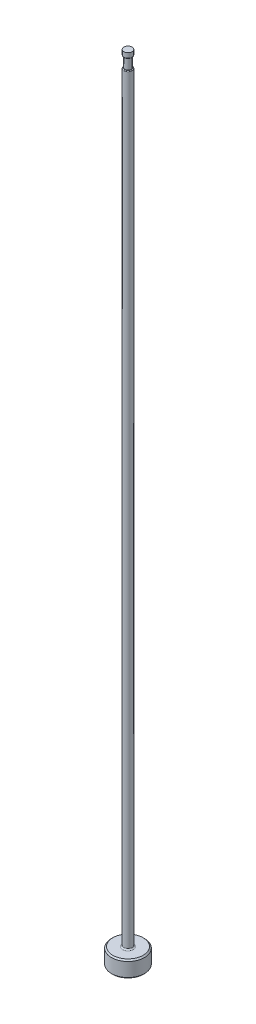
ISO-10303-21;
HEADER;
FILE_DESCRIPTION(('STEP AP214'),'2;1');
FILE_NAME('part.step','',(''),(''),'','','');
FILE_SCHEMA(('AUTOMOTIVE_DESIGN { 1 0 10303 214 1 1 1 1 }'));
ENDSEC;
DATA;
#1=APPLICATION_CONTEXT('core data for automotive mechanical design processes');
#2=APPLICATION_PROTOCOL_DEFINITION('international standard','automotive_design',2000,#1);
#3=PRODUCT_CONTEXT('',#1,'mechanical');
#4=PRODUCT('Part','Part','',(#3));
#5=PRODUCT_RELATED_PRODUCT_CATEGORY('part','',(#4));
#6=PRODUCT_DEFINITION_FORMATION('','',#4);
#7=PRODUCT_DEFINITION_CONTEXT('part definition',#1,'design');
#8=PRODUCT_DEFINITION('design','',#6,#7);
#9=PRODUCT_DEFINITION_SHAPE('','',#8);
#10=(LENGTH_UNIT() NAMED_UNIT(*) SI_UNIT(.MILLI.,.METRE.));
#11=(NAMED_UNIT(*) PLANE_ANGLE_UNIT() SI_UNIT($,.RADIAN.));
#12=(NAMED_UNIT(*) SI_UNIT($,.STERADIAN.) SOLID_ANGLE_UNIT());
#13=UNCERTAINTY_MEASURE_WITH_UNIT(LENGTH_MEASURE(1.E-05),#10,'distance_accuracy_value','');
#14=(GEOMETRIC_REPRESENTATION_CONTEXT(3) GLOBAL_UNCERTAINTY_ASSIGNED_CONTEXT((#13)) GLOBAL_UNIT_ASSIGNED_CONTEXT((#10,
#11,#12)) REPRESENTATION_CONTEXT('',''));
#15=CARTESIAN_POINT('',(0.,0.,0.));
#16=DIRECTION('',(0.,0.,1.));
#17=DIRECTION('',(1.,0.,0.));
#18=AXIS2_PLACEMENT_3D('',#15,#16,#17);
#19=CARTESIAN_POINT('',(-0.793749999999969,151.384,0.));
#20=DIRECTION('',(0.,1.,0.));
#21=DIRECTION('',(0.,0.,1.));
#22=AXIS2_PLACEMENT_3D('',#19,#20,#21);
#23=PLANE('',#22);
#24=CARTESIAN_POINT('',(0.,151.384,0.));
#25=DIRECTION('',(0.,1.,0.));
#26=DIRECTION('',(0.,0.,1.));
#27=AXIS2_PLACEMENT_3D('',#24,#25,#26);
#28=CIRCLE('',#27,0.661669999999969);
#29=CARTESIAN_POINT('',(0.,151.384,0.661669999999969));
#30=VERTEX_POINT('',#29);
#31=EDGE_CURVE('E11',#30,#30,#28,.F.);
#32=ORIENTED_EDGE('',*,*,#31,.T.);
#33=EDGE_LOOP('',(#32));
#34=FACE_BOUND('',#33,.T.);
#35=CARTESIAN_POINT('',(0.,151.384,0.));
#36=DIRECTION('',(0.,1.,0.));
#37=DIRECTION('',(0.,0.,1.));
#38=AXIS2_PLACEMENT_3D('',#35,#36,#37);
#39=CIRCLE('',#38,0.590549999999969);
#40=CARTESIAN_POINT('',(0.,151.384,0.590549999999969));
#41=VERTEX_POINT('',#40);
#42=EDGE_CURVE('E80',#41,#41,#39,.T.);
#43=ORIENTED_EDGE('',*,*,#42,.T.);
#44=EDGE_LOOP('',(#43));
#45=FACE_BOUND('',#44,.T.);
#46=ADVANCED_FACE('F38',(#34,#45),#23,.F.);
#47=CARTESIAN_POINT('',(0.,259.958771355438,0.));
#48=DIRECTION('',(0.,1.,0.));
#49=DIRECTION('',(0.,0.,1.));
#50=AXIS2_PLACEMENT_3D('',#47,#48,#49);
#51=CYLINDRICAL_SURFACE('',#50,0.793749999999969);
#52=DIRECTION('',(0.,1.,0.));
#53=VECTOR('',#52,1.);
#54=CARTESIAN_POINT('',(-0.590549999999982,259.958771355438,-0.530367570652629));
#55=LINE('',#54,#53);
#56=CARTESIAN_POINT('',(-0.590549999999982,149.225,-0.530367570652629));
#57=VERTEX_POINT('',#56);
#58=CARTESIAN_POINT('',(-0.590549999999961,86.868,-0.530367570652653));
#59=VERTEX_POINT('',#58);
#60=EDGE_CURVE('E75',#57,#59,#55,.F.);
#61=ORIENTED_EDGE('',*,*,#60,.F.);
#62=CARTESIAN_POINT('',(0.,149.225,0.));
#63=DIRECTION('',(0.,-1.,0.));
#64=DIRECTION('',(0.,0.,-1.));
#65=AXIS2_PLACEMENT_3D('',#62,#63,#64);
#66=CIRCLE('',#65,0.793749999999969);
#67=CARTESIAN_POINT('',(-0.590549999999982,149.225,0.530367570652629));
#68=VERTEX_POINT('',#67);
#69=EDGE_CURVE('E53',#57,#68,#66,.T.);
#70=ORIENTED_EDGE('',*,*,#69,.T.);
#71=DIRECTION('',(0.,1.,0.));
#72=VECTOR('',#71,1.);
#73=CARTESIAN_POINT('',(-0.590549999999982,259.958771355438,0.530367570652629));
#74=LINE('',#73,#72);
#75=CARTESIAN_POINT('',(-0.590549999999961,86.868,0.530367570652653));
#76=VERTEX_POINT('',#75);
#77=EDGE_CURVE('E86',#76,#68,#74,.T.);
#78=ORIENTED_EDGE('',*,*,#77,.F.);
#79=CARTESIAN_POINT('',(-0.590549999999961,86.868,-0.530367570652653));
#80=CARTESIAN_POINT('',(-0.59053917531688,86.8121966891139,-0.530314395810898));
#81=CARTESIAN_POINT('',(-0.592020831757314,86.7563728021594,-0.528725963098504));
#82=CARTESIAN_POINT('',(-0.597911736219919,86.6448205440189,-0.522091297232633));
#83=CARTESIAN_POINT('',(-0.60233497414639,86.5890939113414,-0.517028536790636));
#84=CARTESIAN_POINT('',(-0.614284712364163,86.4762022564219,-0.502771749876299));
#85=CARTESIAN_POINT('',(-0.62192823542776,86.4190688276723,-0.493420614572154));
#86=CARTESIAN_POINT('',(-0.640090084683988,86.3064288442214,-0.469629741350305));
#87=CARTESIAN_POINT('',(-0.650601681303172,86.2509188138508,-0.455201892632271));
#88=CARTESIAN_POINT('',(-0.672694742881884,86.1487751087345,-0.421752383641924));
#89=CARTESIAN_POINT('',(-0.684015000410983,86.1018538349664,-0.403447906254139));
#90=CARTESIAN_POINT('',(-0.70779345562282,86.0119254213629,-0.360113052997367));
#91=CARTESIAN_POINT('',(-0.720238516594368,85.9688824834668,-0.335155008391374));
#92=CARTESIAN_POINT('',(-0.738199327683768,85.9108429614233,-0.292081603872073));
#93=CARTESIAN_POINT('',(-0.74383162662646,85.8932421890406,-0.277537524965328));
#94=CARTESIAN_POINT('',(-0.754779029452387,85.8599385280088,-0.246220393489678));
#95=CARTESIAN_POINT('',(-0.760093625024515,85.8442386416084,-0.229443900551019));
#96=CARTESIAN_POINT('',(-0.770096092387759,85.8153279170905,-0.193256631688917));
#97=CARTESIAN_POINT('',(-0.774774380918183,85.8021541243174,-0.173812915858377));
#98=CARTESIAN_POINT('',(-0.782879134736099,85.779678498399,-0.132572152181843));
#99=CARTESIAN_POINT('',(-0.786309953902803,85.7703631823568,-0.110783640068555));
#100=CARTESIAN_POINT('',(-0.790553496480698,85.7589260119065,-0.0728220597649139));
#101=CARTESIAN_POINT('',(-0.79185392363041,85.7554525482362,-0.0571082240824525));
#102=CARTESIAN_POINT('',(-0.793506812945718,85.7510442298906,-0.0252785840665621));
#103=CARTESIAN_POINT('',(-0.79385989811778,85.7501077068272,-0.00916305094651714));
#104=CARTESIAN_POINT('',(-0.793579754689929,85.7508527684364,0.0230049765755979));
#105=CARTESIAN_POINT('',(-0.792946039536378,85.7525356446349,0.0390574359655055));
#106=CARTESIAN_POINT('',(-0.790759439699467,85.7583804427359,0.0706385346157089));
#107=CARTESIAN_POINT('',(-0.789205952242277,85.7625439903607,0.0861668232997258));
#108=CARTESIAN_POINT('',(-0.784847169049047,85.7743438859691,0.120053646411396));
#109=CARTESIAN_POINT('',(-0.781828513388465,85.7825809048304,0.138174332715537));
#110=CARTESIAN_POINT('',(-0.774926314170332,85.8017453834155,0.172744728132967));
#111=CARTESIAN_POINT('',(-0.771041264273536,85.8126775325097,0.189191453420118));
#112=CARTESIAN_POINT('',(-0.760742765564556,85.8422791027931,0.227766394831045));
#113=CARTESIAN_POINT('',(-0.754005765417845,85.8621551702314,0.248875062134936));
#114=CARTESIAN_POINT('',(-0.740079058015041,85.90484818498,0.287657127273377));
#115=CARTESIAN_POINT('',(-0.732888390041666,85.9276714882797,0.305322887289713));
#116=CARTESIAN_POINT('',(-0.713188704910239,85.9930259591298,0.349810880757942));
#117=CARTESIAN_POINT('',(-0.700707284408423,86.0375752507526,0.373653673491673));
#118=CARTESIAN_POINT('',(-0.677153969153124,86.1299372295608,0.414797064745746));
#119=CARTESIAN_POINT('',(-0.666086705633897,86.1777598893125,0.432076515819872));
#120=CARTESIAN_POINT('',(-0.646811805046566,86.2711939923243,0.46036763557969));
#121=CARTESIAN_POINT('',(-0.638441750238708,86.3166519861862,0.471784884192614));
#122=CARTESIAN_POINT('',(-0.623612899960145,86.4086203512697,0.491217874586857));
#123=CARTESIAN_POINT('',(-0.617155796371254,86.4551316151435,0.499230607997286));
#124=CARTESIAN_POINT('',(-0.606291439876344,86.5487368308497,0.512368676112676));
#125=CARTESIAN_POINT('',(-0.601882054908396,86.595830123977,0.517497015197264));
#126=CARTESIAN_POINT('',(-0.595168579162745,86.6903714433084,0.525204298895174));
#127=CARTESIAN_POINT('',(-0.592864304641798,86.737819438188,0.527783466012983));
#128=CARTESIAN_POINT('',(-0.591267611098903,86.7991029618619,0.529567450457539));
#129=CARTESIAN_POINT('',(-0.590998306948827,86.8128916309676,0.529867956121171));
#130=CARTESIAN_POINT('',(-0.590639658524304,86.840453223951,0.530267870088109));
#131=CARTESIAN_POINT('',(-0.59055004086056,86.8542261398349,0.530367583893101));
#132=CARTESIAN_POINT('',(-0.59054999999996,86.8679999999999,0.530367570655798));
#133=B_SPLINE_CURVE_WITH_KNOTS('',3,(#79,#80,#81,#82,#83,#84,#85,#86,#87,#88,#89,#90,#91,#92,
#93,#94,#95,#96,#97,#98,#99,#100,#101,#102,#103,#104,#105,#106,#107,#108,#109,#110,#111,#112,
#113,#114,#115,#116,#117,#118,#119,#120,#121,#122,#123,#124,#125,#126,#127,#128,#129,#130,#131,
#132),.UNSPECIFIED.,.F.,.F.,(4,2,2,2,2,2,2,2,2,2,2,2,2,2,2,2,2,2,2,2,2,2,2,2,2,2,4),(0.,
0.167401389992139,0.335604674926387,0.510534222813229,0.685056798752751,0.839551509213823,
0.992430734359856,1.06284216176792,1.13336338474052,1.20485071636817,1.27608609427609,
1.32431373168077,1.37250964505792,1.42072932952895,1.46898064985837,1.52904518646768,
1.58921497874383,1.67801053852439,1.76700089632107,1.92226871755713,2.07803266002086,
2.22066560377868,2.36342432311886,2.50603406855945,2.64863136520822,2.69001340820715,
2.73133244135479),.UNSPECIFIED.);
#134=EDGE_CURVE('E83',#59,#76,#133,.T.);
#135=ORIENTED_EDGE('',*,*,#134,.F.);
#136=EDGE_LOOP('',(#61,#70,#78,#135));
#137=FACE_BOUND('',#136,.T.);
#138=CARTESIAN_POINT('',(0.,3.42900000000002,0.));
#139=DIRECTION('',(0.,1.,0.));
#140=DIRECTION('',(0.,0.,1.));
#141=AXIS2_PLACEMENT_3D('',#138,#139,#140);
#142=CIRCLE('',#141,0.793749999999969);
#143=CARTESIAN_POINT('',(0.,3.42900000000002,0.793749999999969));
#144=VERTEX_POINT('',#143);
#145=EDGE_CURVE('E118',#144,#144,#142,.T.);
#146=ORIENTED_EDGE('',*,*,#145,.T.);
#147=EDGE_LOOP('',(#146));
#148=FACE_BOUND('',#147,.T.);
#149=ADVANCED_FACE('F84',(#137,#148),#51,.T.);
#150=CARTESIAN_POINT('',(0.,0.,0.));
#151=DIRECTION('',(0.,-1.,0.));
#152=DIRECTION('',(0.,0.,-1.));
#153=AXIS2_PLACEMENT_3D('',#150,#151,#152);
#154=PLANE('',#153);
#155=CARTESIAN_POINT('',(0.,0.,0.));
#156=DIRECTION('',(0.,-1.,0.));
#157=DIRECTION('',(0.,0.,-1.));
#158=AXIS2_PLACEMENT_3D('',#155,#156,#157);
#159=CIRCLE('',#158,2.92099999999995);
#160=CARTESIAN_POINT('',(0.,0.,-2.92099999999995));
#161=VERTEX_POINT('',#160);
#162=EDGE_CURVE('E115',#161,#161,#159,.T.);
#163=ORIENTED_EDGE('',*,*,#162,.T.);
#164=EDGE_LOOP('',(#163));
#165=FACE_BOUND('',#164,.T.);
#166=ADVANCED_FACE('F194',(#165),#154,.T.);
#167=CARTESIAN_POINT('',(0.,259.958771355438,0.));
#168=DIRECTION('',(0.,1.,0.));
#169=DIRECTION('',(0.,0.,1.));
#170=AXIS2_PLACEMENT_3D('',#167,#168,#169);
#171=CYLINDRICAL_SURFACE('',#170,3.17499999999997);
#172=CARTESIAN_POINT('',(0.,2.92100000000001,0.));
#173=DIRECTION('',(0.,1.,0.));
#174=DIRECTION('',(0.,0.,1.));
#175=AXIS2_PLACEMENT_3D('',#172,#173,#174);
#176=CIRCLE('',#175,3.17499999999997);
#177=CARTESIAN_POINT('',(0.,2.92100000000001,3.17499999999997));
#178=VERTEX_POINT('',#177);
#179=EDGE_CURVE('E112',#178,#178,#176,.F.);
#180=ORIENTED_EDGE('',*,*,#179,.T.);
#181=EDGE_LOOP('',(#180));
#182=FACE_BOUND('',#181,.T.);
#183=CARTESIAN_POINT('',(0.,0.254000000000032,0.));
#184=DIRECTION('',(0.,-1.,0.));
#185=DIRECTION('',(0.,0.,-1.));
#186=AXIS2_PLACEMENT_3D('',#183,#184,#185);
#187=CIRCLE('',#186,3.17499999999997);
#188=CARTESIAN_POINT('',(0.,0.254000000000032,-3.17499999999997));
#189=VERTEX_POINT('',#188);
#190=EDGE_CURVE('E109',#189,#189,#187,.F.);
#191=ORIENTED_EDGE('',*,*,#190,.T.);
#192=EDGE_LOOP('',(#191));
#193=FACE_BOUND('',#192,.T.);
#194=ADVANCED_FACE('F197',(#182,#193),#171,.T.);
#195=CARTESIAN_POINT('',(-3.17499999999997,3.175,0.));
#196=DIRECTION('',(0.,1.,0.));
#197=DIRECTION('',(0.,0.,1.));
#198=AXIS2_PLACEMENT_3D('',#195,#196,#197);
#199=PLANE('',#198);
#200=CARTESIAN_POINT('',(0.,3.175,0.));
#201=DIRECTION('',(0.,1.,0.));
#202=DIRECTION('',(0.,0.,1.));
#203=AXIS2_PLACEMENT_3D('',#200,#201,#202);
#204=CIRCLE('',#203,1.04774999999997);
#205=CARTESIAN_POINT('',(0.,3.175,1.04774999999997));
#206=VERTEX_POINT('',#205);
#207=EDGE_CURVE('E89',#206,#206,#204,.F.);
#208=ORIENTED_EDGE('',*,*,#207,.T.);
#209=EDGE_LOOP('',(#208));
#210=FACE_BOUND('',#209,.T.);
#211=CARTESIAN_POINT('',(0.,3.175,0.));
#212=DIRECTION('',(0.,1.,0.));
#213=DIRECTION('',(0.,0.,1.));
#214=AXIS2_PLACEMENT_3D('',#211,#212,#213);
#215=CIRCLE('',#214,2.92099999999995);
#216=CARTESIAN_POINT('',(0.,3.175,2.92099999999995));
#217=VERTEX_POINT('',#216);
#218=EDGE_CURVE('E106',#217,#217,#215,.T.);
#219=ORIENTED_EDGE('',*,*,#218,.T.);
#220=EDGE_LOOP('',(#219));
#221=FACE_BOUND('',#220,.T.);
#222=ADVANCED_FACE('F192',(#210,#221),#199,.T.);
#223=CARTESIAN_POINT('',(0.,3.17499999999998,0.));
#224=DIRECTION('',(0.,-1.,0.));
#225=DIRECTION('',(0.,0.,-1.));
#226=AXIS2_PLACEMENT_3D('',#223,#224,#225);
#227=CONICAL_SURFACE('',#226,2.92099999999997,0.7853981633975);
#228=ORIENTED_EDGE('',*,*,#179,.F.);
#229=EDGE_LOOP('',(#228));
#230=FACE_BOUND('',#229,.T.);
#231=ORIENTED_EDGE('',*,*,#218,.F.);
#232=EDGE_LOOP('',(#231));
#233=FACE_BOUND('',#232,.T.);
#234=ADVANCED_FACE('F188',(#230,#233),#227,.T.);
#235=CARTESIAN_POINT('',(0.,0.254000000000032,0.));
#236=DIRECTION('',(0.,1.,0.));
#237=DIRECTION('',(0.,0.,1.));
#238=AXIS2_PLACEMENT_3D('',#235,#236,#237);
#239=CONICAL_SURFACE('',#238,3.17499999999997,0.785398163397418);
#240=ORIENTED_EDGE('',*,*,#162,.F.);
#241=EDGE_LOOP('',(#240));
#242=FACE_BOUND('',#241,.T.);
#243=ORIENTED_EDGE('',*,*,#190,.F.);
#244=EDGE_LOOP('',(#243));
#245=FACE_BOUND('',#244,.T.);
#246=ADVANCED_FACE('F184',(#242,#245),#239,.T.);
#247=CARTESIAN_POINT('',(0.,3.42900000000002,0.));
#248=DIRECTION('',(0.,1.,0.));
#249=DIRECTION('',(0.,0.,1.));
#250=AXIS2_PLACEMENT_3D('',#247,#248,#249);
#251=TOROIDAL_SURFACE('',#250,1.04774999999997,0.254);
#252=ORIENTED_EDGE('',*,*,#207,.F.);
#253=EDGE_LOOP('',(#252));
#254=FACE_BOUND('',#253,.T.);
#255=ORIENTED_EDGE('',*,*,#145,.F.);
#256=EDGE_LOOP('',(#255));
#257=FACE_BOUND('',#256,.T.);
#258=ADVANCED_FACE('F149',(#254,#257),#251,.F.);
#259=CARTESIAN_POINT('',(-0.793749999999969,149.352,0.));
#260=DIRECTION('',(0.,-1.,0.));
#261=DIRECTION('',(0.,0.,-1.));
#262=AXIS2_PLACEMENT_3D('',#259,#260,#261);
#263=PLANE('',#262);
#264=DIRECTION('',(0.,0.,1.));
#265=VECTOR('',#264,1.);
#266=CARTESIAN_POINT('',(-0.590549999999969,149.352,0.));
#267=LINE('',#266,#265);
#268=CARTESIAN_POINT('',(-0.590549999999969,149.352,0.));
#269=VERTEX_POINT('',#268);
#270=CARTESIAN_POINT('',(-0.590549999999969,149.352,0.309525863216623));
#271=VERTEX_POINT('',#270);
#272=EDGE_CURVE('E92',#269,#271,#267,.T.);
#273=ORIENTED_EDGE('',*,*,#272,.T.);
#274=CARTESIAN_POINT('',(0.,149.352,0.));
#275=DIRECTION('',(0.,-1.,0.));
#276=DIRECTION('',(0.,0.,-1.));
#277=AXIS2_PLACEMENT_3D('',#274,#275,#276);
#278=CIRCLE('',#277,0.666749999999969);
#279=CARTESIAN_POINT('',(-0.590549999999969,149.352,-0.309525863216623));
#280=VERTEX_POINT('',#279);
#281=EDGE_CURVE('E88',#271,#280,#278,.F.);
#282=ORIENTED_EDGE('',*,*,#281,.T.);
#283=EDGE_CURVE('E81',#280,#269,#267,.T.);
#284=ORIENTED_EDGE('',*,*,#283,.T.);
#285=CARTESIAN_POINT('',(0.,149.352,0.));
#286=DIRECTION('',(0.,1.,0.));
#287=DIRECTION('',(0.,0.,1.));
#288=AXIS2_PLACEMENT_3D('',#285,#286,#287);
#289=CIRCLE('',#288,0.590549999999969);
#290=EDGE_CURVE('E103',#269,#269,#289,.T.);
#291=ORIENTED_EDGE('',*,*,#290,.F.);
#292=EDGE_LOOP('',(#273,#282,#284,#291));
#293=FACE_BOUND('',#292,.T.);
#294=ADVANCED_FACE('F146',(#293),#263,.F.);
#295=CARTESIAN_POINT('',(0.,153.448281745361,0.));
#296=DIRECTION('',(0.,1.,0.));
#297=DIRECTION('',(0.,0.,1.));
#298=AXIS2_PLACEMENT_3D('',#295,#296,#297);
#299=CYLINDRICAL_SURFACE('',#298,0.590549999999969);
#300=ORIENTED_EDGE('',*,*,#42,.F.);
#301=EDGE_LOOP('',(#300));
#302=FACE_BOUND('',#301,.T.);
#303=ORIENTED_EDGE('',*,*,#290,.T.);
#304=EDGE_LOOP('',(#303));
#305=FACE_BOUND('',#304,.T.);
#306=ADVANCED_FACE('F143',(#302,#305),#299,.T.);
#307=CARTESIAN_POINT('',(-0.590549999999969,150.368,-3.17499999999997));
#308=DIRECTION('',(1.,0.,0.));
#309=DIRECTION('',(0.,1.,0.));
#310=AXIS2_PLACEMENT_3D('',#307,#308,#309);
#311=PLANE('',#310);
#312=ORIENTED_EDGE('',*,*,#283,.F.);
#313=CARTESIAN_POINT('',(-0.590549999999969,149.352,-0.309525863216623));
#314=CARTESIAN_POINT('',(-0.590549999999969,149.351996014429,-0.320154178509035));
#315=CARTESIAN_POINT('',(-0.590549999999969,149.351711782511,-0.330794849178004));
#316=CARTESIAN_POINT('',(-0.590549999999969,149.350412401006,-0.352104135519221));
#317=CARTESIAN_POINT('',(-0.590549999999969,149.349392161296,-0.362772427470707));
#318=CARTESIAN_POINT('',(-0.590549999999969,149.346423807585,-0.384147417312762));
#319=CARTESIAN_POINT('',(-0.590549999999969,149.344462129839,-0.394852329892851));
#320=CARTESIAN_POINT('',(-0.590549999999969,149.339396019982,-0.415965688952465));
#321=CARTESIAN_POINT('',(-0.590549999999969,149.33629522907,-0.426374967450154));
#322=CARTESIAN_POINT('',(-0.590549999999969,149.329886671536,-0.443512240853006));
#323=CARTESIAN_POINT('',(-0.590549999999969,149.326944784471,-0.450376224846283));
#324=CARTESIAN_POINT('',(-0.590549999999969,149.320316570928,-0.463725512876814));
#325=CARTESIAN_POINT('',(-0.590549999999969,149.316631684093,-0.470211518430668));
#326=CARTESIAN_POINT('',(-0.590549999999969,149.308387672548,-0.482700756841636));
#327=CARTESIAN_POINT('',(-0.590549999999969,149.303820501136,-0.488698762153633));
#328=CARTESIAN_POINT('',(-0.590549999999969,149.293766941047,-0.499879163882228));
#329=CARTESIAN_POINT('',(-0.590549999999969,149.288281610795,-0.505062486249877));
#330=CARTESIAN_POINT('',(-0.590549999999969,149.278008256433,-0.513019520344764));
#331=CARTESIAN_POINT('',(-0.590549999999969,149.273432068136,-0.5160659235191));
#332=CARTESIAN_POINT('',(-0.590549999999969,149.263852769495,-0.521376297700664));
#333=CARTESIAN_POINT('',(-0.590549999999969,149.258850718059,-0.523642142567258));
#334=CARTESIAN_POINT('',(-0.590549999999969,149.249098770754,-0.527042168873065));
#335=CARTESIAN_POINT('',(-0.590549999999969,149.244383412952,-0.528274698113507));
#336=CARTESIAN_POINT('',(-0.590549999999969,149.23478232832,-0.529944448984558));
#337=CARTESIAN_POINT('',(-0.590549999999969,149.22989566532,-0.530376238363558));
#338=CARTESIAN_POINT('',(-0.590549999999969,149.225,-0.530367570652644));
#339=B_SPLINE_CURVE_WITH_KNOTS('',3,(#313,#314,#315,#316,#317,#318,#319,#320,#321,#322,#323,
#324,#325,#326,#327,#328,#329,#330,#331,#332,#333,#334,#335,#336,#337,#338),.UNSPECIFIED.,.F.,
.F.,(4,2,2,2,2,2,2,2,2,2,2,2,4),(0.,0.0319002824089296,0.0640233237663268,0.0966237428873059,
0.129120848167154,0.151487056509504,0.173810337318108,0.196347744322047,0.218859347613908,
0.235290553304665,0.25168203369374,0.266237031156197,0.280890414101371),.UNSPECIFIED.);
#340=EDGE_CURVE('E61',#280,#57,#339,.T.);
#341=ORIENTED_EDGE('',*,*,#340,.T.);
#342=ORIENTED_EDGE('',*,*,#60,.T.);
#343=DIRECTION('',(0.,0.,1.));
#344=VECTOR('',#343,1.);
#345=CARTESIAN_POINT('',(-0.590549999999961,86.868,-3.17499999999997));
#346=LINE('',#345,#344);
#347=EDGE_CURVE('E79',#59,#76,#346,.T.);
#348=ORIENTED_EDGE('',*,*,#347,.T.);
#349=ORIENTED_EDGE('',*,*,#77,.T.);
#350=CARTESIAN_POINT('',(-0.590549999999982,149.225,0.530367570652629));
#351=CARTESIAN_POINT('',(-0.590549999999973,149.230430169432,0.53038055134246));
#352=CARTESIAN_POINT('',(-0.59054999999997,149.235846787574,0.529847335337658));
#353=CARTESIAN_POINT('',(-0.590549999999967,149.246444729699,0.527800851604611));
#354=CARTESIAN_POINT('',(-0.590549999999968,149.251627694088,0.526296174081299));
#355=CARTESIAN_POINT('',(-0.590549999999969,149.261636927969,0.522420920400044));
#356=CARTESIAN_POINT('',(-0.590549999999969,149.266464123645,0.520052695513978));
#357=CARTESIAN_POINT('',(-0.590549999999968,149.275699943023,0.514595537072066));
#358=CARTESIAN_POINT('',(-0.590549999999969,149.280107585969,0.511504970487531));
#359=CARTESIAN_POINT('',(-0.590549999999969,149.290154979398,0.503374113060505));
#360=CARTESIAN_POINT('',(-0.590549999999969,149.295566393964,0.498052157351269));
#361=CARTESIAN_POINT('',(-0.590549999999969,149.30546695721,0.486619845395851));
#362=CARTESIAN_POINT('',(-0.590549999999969,149.309954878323,0.480508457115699));
#363=CARTESIAN_POINT('',(-0.590549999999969,149.320155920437,0.464496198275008));
#364=CARTESIAN_POINT('',(-0.590549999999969,149.325326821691,0.454252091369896));
#365=CARTESIAN_POINT('',(-0.590549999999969,149.33406747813,0.433065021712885));
#366=CARTESIAN_POINT('',(-0.590549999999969,149.337627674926,0.422118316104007));
#367=CARTESIAN_POINT('',(-0.590549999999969,149.344882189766,0.394326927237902));
#368=CARTESIAN_POINT('',(-0.590549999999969,149.347749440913,0.377275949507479));
#369=CARTESIAN_POINT('',(-0.590549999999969,149.351271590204,0.343282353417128));
#370=CARTESIAN_POINT('',(-0.590549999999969,149.351970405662,0.326344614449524));
#371=CARTESIAN_POINT('',(-0.590549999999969,149.352,0.309525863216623));
#372=B_SPLINE_CURVE_WITH_KNOTS('',3,(#350,#351,#352,#353,#354,#355,#356,#357,#358,#359,#360,
#361,#362,#363,#364,#365,#366,#367,#368,#369,#370,#371),.UNSPECIFIED.,.F.,.F.,(4,2,2,2,2,2,2,2,
2,2,4),(0.,0.0162429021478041,0.0323441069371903,0.0484017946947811,0.064496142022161,
0.0871387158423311,0.109811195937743,0.144045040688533,0.178479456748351,0.230172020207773,
0.280810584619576),.UNSPECIFIED.);
#373=EDGE_CURVE('E174',#68,#271,#372,.T.);
#374=ORIENTED_EDGE('',*,*,#373,.T.);
#375=ORIENTED_EDGE('',*,*,#272,.F.);
#376=EDGE_LOOP('',(#312,#341,#342,#348,#349,#374,#375));
#377=FACE_BOUND('',#376,.T.);
#378=ADVANCED_FACE('F77',(#377),#311,.F.);
#379=CARTESIAN_POINT('',(-3.76554999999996,86.868,-3.17499999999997));
#380=DIRECTION('',(0.,0.,1.));
#381=DIRECTION('',(1.,0.,0.));
#382=AXIS2_PLACEMENT_3D('',#379,#380,#381);
#383=CYLINDRICAL_SURFACE('',#382,3.175);
#384=ORIENTED_EDGE('',*,*,#347,.F.);
#385=ORIENTED_EDGE('',*,*,#134,.T.);
#386=EDGE_LOOP('',(#384,#385));
#387=FACE_BOUND('',#386,.T.);
#388=ADVANCED_FACE('F91',(#387),#383,.F.);
#389=CARTESIAN_POINT('',(0.,152.687735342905,0.));
#390=DIRECTION('',(0.,1.,0.));
#391=DIRECTION('',(0.,0.,1.));
#392=AXIS2_PLACEMENT_3D('',#389,#390,#391);
#393=CYLINDRICAL_SURFACE('',#392,0.788669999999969);
#394=CARTESIAN_POINT('',(0.,151.511,0.));
#395=DIRECTION('',(0.,1.,0.));
#396=DIRECTION('',(0.,0.,1.));
#397=AXIS2_PLACEMENT_3D('',#394,#395,#396);
#398=CIRCLE('',#397,0.788669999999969);
#399=CARTESIAN_POINT('',(0.,151.511,0.788669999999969));
#400=VERTEX_POINT('',#399);
#401=EDGE_CURVE('E46',#400,#400,#398,.T.);
#402=ORIENTED_EDGE('',*,*,#401,.T.);
#403=EDGE_LOOP('',(#402));
#404=FACE_BOUND('',#403,.T.);
#405=CARTESIAN_POINT('',(0.,152.4,0.));
#406=DIRECTION('',(0.,1.,0.));
#407=DIRECTION('',(0.,0.,1.));
#408=AXIS2_PLACEMENT_3D('',#405,#406,#407);
#409=CIRCLE('',#408,0.788669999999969);
#410=CARTESIAN_POINT('',(0.,152.4,0.788669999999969));
#411=VERTEX_POINT('',#410);
#412=EDGE_CURVE('E93',#411,#411,#409,.T.);
#413=ORIENTED_EDGE('',*,*,#412,.F.);
#414=EDGE_LOOP('',(#413));
#415=FACE_BOUND('',#414,.T.);
#416=ADVANCED_FACE('F137',(#404,#415),#393,.T.);
#417=CARTESIAN_POINT('',(-0.793749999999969,152.4,0.));
#418=DIRECTION('',(0.,1.,0.));
#419=DIRECTION('',(0.,0.,1.));
#420=AXIS2_PLACEMENT_3D('',#417,#418,#419);
#421=PLANE('',#420);
#422=ORIENTED_EDGE('',*,*,#412,.T.);
#423=EDGE_LOOP('',(#422));
#424=FACE_BOUND('',#423,.T.);
#425=ADVANCED_FACE('F151',(#424),#421,.T.);
#426=CARTESIAN_POINT('',(0.,149.225,0.));
#427=DIRECTION('',(0.,-1.,0.));
#428=DIRECTION('',(0.,0.,-1.));
#429=AXIS2_PLACEMENT_3D('',#426,#427,#428);
#430=TOROIDAL_SURFACE('',#429,0.666749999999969,0.127);
#431=ORIENTED_EDGE('',*,*,#373,.F.);
#432=ORIENTED_EDGE('',*,*,#69,.F.);
#433=ORIENTED_EDGE('',*,*,#340,.F.);
#434=ORIENTED_EDGE('',*,*,#281,.F.);
#435=EDGE_LOOP('',(#431,#432,#433,#434));
#436=FACE_BOUND('',#435,.T.);
#437=ADVANCED_FACE('F153',(#436),#430,.T.);
#438=CARTESIAN_POINT('',(0.,151.511,0.));
#439=DIRECTION('',(0.,1.,0.));
#440=DIRECTION('',(0.,0.,1.));
#441=AXIS2_PLACEMENT_3D('',#438,#439,#440);
#442=TOROIDAL_SURFACE('',#441,0.661669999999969,0.127);
#443=ORIENTED_EDGE('',*,*,#31,.F.);
#444=EDGE_LOOP('',(#443));
#445=FACE_BOUND('',#444,.T.);
#446=ORIENTED_EDGE('',*,*,#401,.F.);
#447=EDGE_LOOP('',(#446));
#448=FACE_BOUND('',#447,.T.);
#449=ADVANCED_FACE('F40',(#445,#448),#442,.T.);
#450=CLOSED_SHELL('',(#46,#149,#166,#194,#222,#234,#246,#258,#294,#306,#378,#388,#416,#425,#437,#449));
#451=MANIFOLD_SOLID_BREP('B2',#450);
#452=ADVANCED_BREP_SHAPE_REPRESENTATION('',(#18,#451),#14);
#453=SHAPE_DEFINITION_REPRESENTATION(#9,#452);
ENDSEC;
END-ISO-10303-21;
